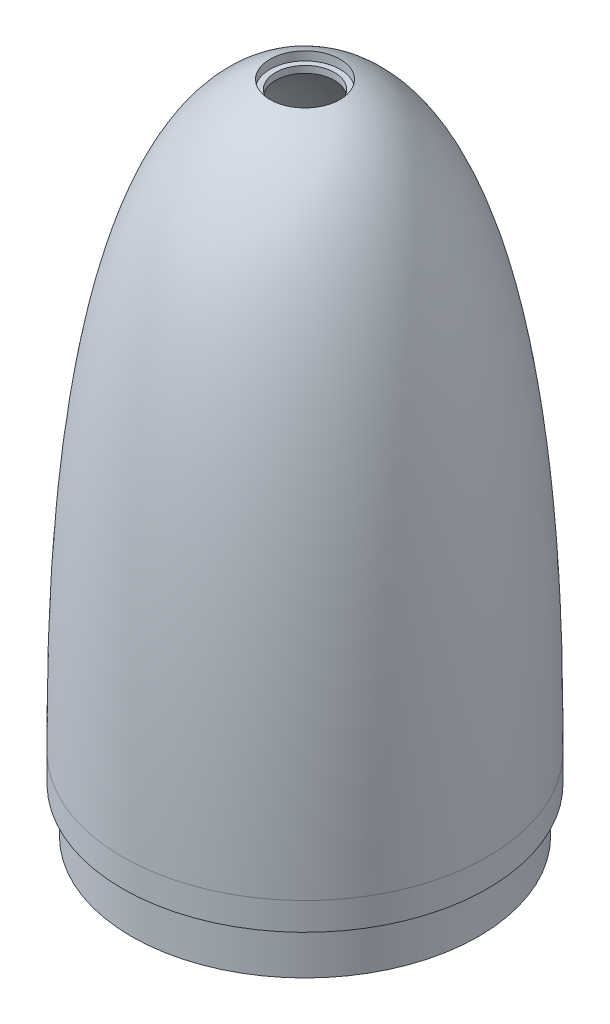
ISO-10303-21;
HEADER;
FILE_DESCRIPTION(('STEP AP214'),'2;1');
FILE_NAME('part.step','',(''),(''),'','','');
FILE_SCHEMA(('AUTOMOTIVE_DESIGN { 1 0 10303 214 1 1 1 1 }'));
ENDSEC;
DATA;
#1=APPLICATION_CONTEXT('core data for automotive mechanical design processes');
#2=APPLICATION_PROTOCOL_DEFINITION('international standard','automotive_design',2000,#1);
#3=PRODUCT_CONTEXT('',#1,'mechanical');
#4=PRODUCT('Part','Part','',(#3));
#5=PRODUCT_RELATED_PRODUCT_CATEGORY('part','',(#4));
#6=PRODUCT_DEFINITION_FORMATION('','',#4);
#7=PRODUCT_DEFINITION_CONTEXT('part definition',#1,'design');
#8=PRODUCT_DEFINITION('design','',#6,#7);
#9=PRODUCT_DEFINITION_SHAPE('','',#8);
#10=(LENGTH_UNIT() NAMED_UNIT(*) SI_UNIT(.MILLI.,.METRE.));
#11=(NAMED_UNIT(*) PLANE_ANGLE_UNIT() SI_UNIT($,.RADIAN.));
#12=(NAMED_UNIT(*) SI_UNIT($,.STERADIAN.) SOLID_ANGLE_UNIT());
#13=UNCERTAINTY_MEASURE_WITH_UNIT(LENGTH_MEASURE(1.E-05),#10,'distance_accuracy_value','');
#14=(GEOMETRIC_REPRESENTATION_CONTEXT(3) GLOBAL_UNCERTAINTY_ASSIGNED_CONTEXT((#13)) GLOBAL_UNIT_ASSIGNED_CONTEXT((#10,
#11,#12)) REPRESENTATION_CONTEXT('',''));
#15=CARTESIAN_POINT('',(0.,0.,0.));
#16=DIRECTION('',(0.,0.,1.));
#17=DIRECTION('',(1.,0.,0.));
#18=AXIS2_PLACEMENT_3D('',#15,#16,#17);
#19=CARTESIAN_POINT('',(33.1,13.2999999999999,0.));
#20=CARTESIAN_POINT('',(33.1,40.9226204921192,0.));
#21=CARTESIAN_POINT('',(32.5499463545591,120.,0.));
#22=CARTESIAN_POINT('',(0.,120.,0.));
#23=B_SPLINE_CURVE_WITH_KNOTS('',3,(#19,#20,#21,#22),.UNSPECIFIED.,.F.,.F.,(4,4),(0.,1.),.UNSPECIFIED.);
#24=CARTESIAN_POINT('',(0.,120.,0.));
#25=DIRECTION('',(0.,1.,0.));
#26=AXIS1_PLACEMENT('',#24,#25);
#27=SURFACE_OF_REVOLUTION('',#23,#26);
#28=CARTESIAN_POINT('',(0.,118.891876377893,0.));
#29=DIRECTION('',(0.,1.,0.));
#30=DIRECTION('',(0.,0.,1.));
#31=AXIS2_PLACEMENT_3D('',#28,#29,#30);
#32=CIRCLE('',#31,6.35000000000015);
#33=CARTESIAN_POINT('',(0.,118.891876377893,6.35000000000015));
#34=VERTEX_POINT('',#33);
#35=EDGE_CURVE('E41',#34,#34,#32,.F.);
#36=ORIENTED_EDGE('',*,*,#35,.T.);
#37=EDGE_LOOP('',(#36));
#38=FACE_BOUND('',#37,.T.);
#39=CARTESIAN_POINT('',(0.,13.3,0.));
#40=DIRECTION('',(0.,1.,0.));
#41=DIRECTION('',(0.,0.,1.));
#42=AXIS2_PLACEMENT_3D('',#39,#40,#41);
#43=CIRCLE('',#42,33.1);
#44=CARTESIAN_POINT('',(0.,13.3,33.1));
#45=VERTEX_POINT('',#44);
#46=EDGE_CURVE('E59',#45,#45,#43,.T.);
#47=ORIENTED_EDGE('',*,*,#46,.T.);
#48=EDGE_LOOP('',(#47));
#49=FACE_BOUND('',#48,.T.);
#50=ADVANCED_FACE('F37',(#38,#49),#27,.T.);
#51=CARTESIAN_POINT('',(0.,117.,0.));
#52=CARTESIAN_POINT('',(0.424061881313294,117.,0.));
#53=CARTESIAN_POINT('',(1.28356271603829,116.967183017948,0.));
#54=CARTESIAN_POINT('',(2.90414984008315,116.776102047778,0.));
#55=CARTESIAN_POINT('',(4.82741332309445,116.311450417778,0.));
#56=CARTESIAN_POINT('',(6.99178935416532,115.407503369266,0.));
#57=CARTESIAN_POINT('',(9.73527188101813,113.74167072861,0.));
#58=CARTESIAN_POINT('',(12.9354102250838,110.783808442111,0.));
#59=CARTESIAN_POINT('',(16.392615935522,105.885181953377,0.));
#60=CARTESIAN_POINT('',(19.4148320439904,99.8036949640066,0.));
#61=CARTESIAN_POINT('',(22.8482524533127,90.3913900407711,0.));
#62=CARTESIAN_POINT('',(26.050874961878,76.7109826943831,0.));
#63=CARTESIAN_POINT('',(28.020441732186,61.8446115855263,0.));
#64=CARTESIAN_POINT('',(29.0269907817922,50.0309970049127,0.));
#65=CARTESIAN_POINT('',(29.5416888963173,41.4052129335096,0.));
#66=CARTESIAN_POINT('',(29.8611044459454,33.2078002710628,0.));
#67=CARTESIAN_POINT('',(30.0023390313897,26.8937011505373,0.));
#68=CARTESIAN_POINT('',(30.0631450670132,22.2490111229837,0.));
#69=CARTESIAN_POINT('',(30.0883692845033,18.9904541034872,0.));
#70=CARTESIAN_POINT('',(30.0971671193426,16.4888333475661,0.));
#71=CARTESIAN_POINT('',(30.0997317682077,14.6120845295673,0.));
#72=CARTESIAN_POINT('',(30.1,13.7431480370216,0.));
#73=CARTESIAN_POINT('',(30.1,13.2999999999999,0.));
#74=B_SPLINE_CURVE_WITH_KNOTS('',3,(#51,#52,#53,#54,#55,#56,#57,#58,#59,#60,#61,#62,#63,#64,#65,
#66,#67,#68,#69,#70,#71,#72,#73),.UNSPECIFIED.,.F.,.F.,(4,1,1,1,1,1,1,1,1,1,1,1,1,1,1,1,1,1,1,1,
4),(0.,0.015625,0.03125,0.0625,0.09375,0.125,0.1875,0.25,0.3125,0.375,0.5,0.625,0.6875,0.75,
0.8125,0.875,0.90625,0.9375,0.96875,0.984375,1.),.UNSPECIFIED.);
#75=CARTESIAN_POINT('',(0.,120.,0.));
#76=DIRECTION('',(0.,1.,0.));
#77=AXIS1_PLACEMENT('',#75,#76);
#78=SURFACE_OF_REVOLUTION('',#74,#77);
#79=CARTESIAN_POINT('',(0.,116.063228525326,0.));
#80=DIRECTION('',(0.,1.,0.));
#81=DIRECTION('',(0.,0.,1.));
#82=AXIS2_PLACEMENT_3D('',#79,#80,#81);
#83=CIRCLE('',#82,5.34999999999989);
#84=CARTESIAN_POINT('',(0.,116.063228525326,5.34999999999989));
#85=VERTEX_POINT('',#84);
#86=EDGE_CURVE('E53',#85,#85,#83,.T.);
#87=ORIENTED_EDGE('',*,*,#86,.T.);
#88=EDGE_LOOP('',(#87));
#89=FACE_BOUND('',#88,.T.);
#90=CARTESIAN_POINT('',(0.,13.2999999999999,0.));
#91=DIRECTION('',(0.,1.,0.));
#92=DIRECTION('',(0.,0.,1.));
#93=AXIS2_PLACEMENT_3D('',#90,#91,#92);
#94=CIRCLE('',#93,30.1);
#95=CARTESIAN_POINT('',(0.,13.2999999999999,30.1));
#96=VERTEX_POINT('',#95);
#97=EDGE_CURVE('E10',#96,#96,#94,.T.);
#98=ORIENTED_EDGE('',*,*,#97,.F.);
#99=EDGE_LOOP('',(#98));
#100=FACE_BOUND('',#99,.T.);
#101=ADVANCED_FACE('F82',(#89,#100),#78,.T.);
#102=CARTESIAN_POINT('',(0.,120.,0.));
#103=DIRECTION('',(0.,1.,0.));
#104=DIRECTION('',(0.,0.,1.));
#105=AXIS2_PLACEMENT_3D('',#102,#103,#104);
#106=CYLINDRICAL_SURFACE('',#105,30.1);
#107=CARTESIAN_POINT('',(0.,0.,0.));
#108=DIRECTION('',(0.,1.,0.));
#109=DIRECTION('',(0.,0.,1.));
#110=AXIS2_PLACEMENT_3D('',#107,#108,#109);
#111=CIRCLE('',#110,30.1);
#112=CARTESIAN_POINT('',(0.,0.,30.1));
#113=VERTEX_POINT('',#112);
#114=EDGE_CURVE('E45',#113,#113,#111,.T.);
#115=ORIENTED_EDGE('',*,*,#114,.F.);
#116=EDGE_LOOP('',(#115));
#117=FACE_BOUND('',#116,.T.);
#118=ORIENTED_EDGE('',*,*,#97,.T.);
#119=EDGE_LOOP('',(#118));
#120=FACE_BOUND('',#119,.T.);
#121=ADVANCED_FACE('F85',(#117,#120),#106,.F.);
#122=CARTESIAN_POINT('',(30.1,0.,0.));
#123=DIRECTION('',(0.,1.,0.));
#124=DIRECTION('',(0.,0.,1.));
#125=AXIS2_PLACEMENT_3D('',#122,#123,#124);
#126=PLANE('',#125);
#127=CARTESIAN_POINT('',(0.,0.,0.));
#128=DIRECTION('',(0.,1.,0.));
#129=DIRECTION('',(0.,0.,1.));
#130=AXIS2_PLACEMENT_3D('',#127,#128,#129);
#131=CIRCLE('',#130,31.5);
#132=CARTESIAN_POINT('',(0.,0.,31.5));
#133=VERTEX_POINT('',#132);
#134=EDGE_CURVE('E50',#133,#133,#131,.T.);
#135=ORIENTED_EDGE('',*,*,#134,.F.);
#136=EDGE_LOOP('',(#135));
#137=FACE_BOUND('',#136,.T.);
#138=ORIENTED_EDGE('',*,*,#114,.T.);
#139=EDGE_LOOP('',(#138));
#140=FACE_BOUND('',#139,.T.);
#141=ADVANCED_FACE('F88',(#137,#140),#126,.F.);
#142=CARTESIAN_POINT('',(0.,120.,0.));
#143=DIRECTION('',(0.,1.,0.));
#144=DIRECTION('',(0.,0.,1.));
#145=AXIS2_PLACEMENT_3D('',#142,#143,#144);
#146=CYLINDRICAL_SURFACE('',#145,31.5);
#147=CARTESIAN_POINT('',(0.,8.3,0.));
#148=DIRECTION('',(0.,1.,0.));
#149=DIRECTION('',(0.,0.,1.));
#150=AXIS2_PLACEMENT_3D('',#147,#148,#149);
#151=CIRCLE('',#150,31.5);
#152=CARTESIAN_POINT('',(0.,8.3,31.5));
#153=VERTEX_POINT('',#152);
#154=EDGE_CURVE('E129',#153,#153,#151,.T.);
#155=ORIENTED_EDGE('',*,*,#154,.F.);
#156=EDGE_LOOP('',(#155));
#157=FACE_BOUND('',#156,.T.);
#158=ORIENTED_EDGE('',*,*,#134,.T.);
#159=EDGE_LOOP('',(#158));
#160=FACE_BOUND('',#159,.T.);
#161=ADVANCED_FACE('F92',(#157,#160),#146,.T.);
#162=CARTESIAN_POINT('',(31.5,8.3,0.));
#163=DIRECTION('',(0.,1.,0.));
#164=DIRECTION('',(0.,0.,1.));
#165=AXIS2_PLACEMENT_3D('',#162,#163,#164);
#166=PLANE('',#165);
#167=CARTESIAN_POINT('',(0.,8.3,0.));
#168=DIRECTION('',(0.,1.,0.));
#169=DIRECTION('',(0.,0.,1.));
#170=AXIS2_PLACEMENT_3D('',#167,#168,#169);
#171=CIRCLE('',#170,33.1);
#172=CARTESIAN_POINT('',(0.,8.3,33.1));
#173=VERTEX_POINT('',#172);
#174=EDGE_CURVE('E127',#173,#173,#171,.T.);
#175=ORIENTED_EDGE('',*,*,#174,.F.);
#176=EDGE_LOOP('',(#175));
#177=FACE_BOUND('',#176,.T.);
#178=ORIENTED_EDGE('',*,*,#154,.T.);
#179=EDGE_LOOP('',(#178));
#180=FACE_BOUND('',#179,.T.);
#181=ADVANCED_FACE('F96',(#177,#180),#166,.F.);
#182=CARTESIAN_POINT('',(0.,120.,0.));
#183=DIRECTION('',(0.,1.,0.));
#184=DIRECTION('',(0.,0.,1.));
#185=AXIS2_PLACEMENT_3D('',#182,#183,#184);
#186=CYLINDRICAL_SURFACE('',#185,33.1);
#187=ORIENTED_EDGE('',*,*,#46,.F.);
#188=EDGE_LOOP('',(#187));
#189=FACE_BOUND('',#188,.T.);
#190=ORIENTED_EDGE('',*,*,#174,.T.);
#191=EDGE_LOOP('',(#190));
#192=FACE_BOUND('',#191,.T.);
#193=ADVANCED_FACE('F100',(#189,#192),#186,.T.);
#194=CARTESIAN_POINT('',(3.43024899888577E-12,-1000.,0.));
#195=DIRECTION('',(0.,-1.,0.));
#196=DIRECTION('',(1.,0.,0.));
#197=AXIS2_PLACEMENT_3D('',#194,#195,#196);
#198=CYLINDRICAL_SURFACE('',#197,6.35000000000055);
#199=CARTESIAN_POINT('',(-4.02383219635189E-13,117.304376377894,0.));
#200=DIRECTION('',(0.,-1.,0.));
#201=DIRECTION('',(1.,0.,0.));
#202=AXIS2_PLACEMENT_3D('',#199,#200,#201);
#203=CIRCLE('',#202,6.35000000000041);
#204=CARTESIAN_POINT('',(6.35000000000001,117.304376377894,0.));
#205=VERTEX_POINT('',#204);
#206=EDGE_CURVE('E55',#205,#205,#203,.T.);
#207=ORIENTED_EDGE('',*,*,#206,.T.);
#208=EDGE_LOOP('',(#207));
#209=FACE_BOUND('',#208,.T.);
#210=ORIENTED_EDGE('',*,*,#35,.F.);
#211=EDGE_LOOP('',(#210));
#212=FACE_BOUND('',#211,.T.);
#213=ADVANCED_FACE('F104',(#209,#212),#198,.F.);
#214=CARTESIAN_POINT('',(3.43024899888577E-12,-1000.,0.));
#215=DIRECTION('',(0.,-1.,0.));
#216=DIRECTION('',(1.,0.,0.));
#217=AXIS2_PLACEMENT_3D('',#214,#215,#216);
#218=CYLINDRICAL_SURFACE('',#217,5.35000000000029);
#219=CARTESIAN_POINT('',(-4.02383219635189E-13,117.304376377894,0.));
#220=DIRECTION('',(0.,-1.,0.));
#221=DIRECTION('',(1.,0.,0.));
#222=AXIS2_PLACEMENT_3D('',#219,#220,#221);
#223=CIRCLE('',#222,5.35000000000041);
#224=CARTESIAN_POINT('',(5.35000000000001,117.304376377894,0.));
#225=VERTEX_POINT('',#224);
#226=EDGE_CURVE('E61',#225,#225,#223,.T.);
#227=ORIENTED_EDGE('',*,*,#226,.F.);
#228=EDGE_LOOP('',(#227));
#229=FACE_BOUND('',#228,.T.);
#230=ORIENTED_EDGE('',*,*,#86,.F.);
#231=EDGE_LOOP('',(#230));
#232=FACE_BOUND('',#231,.T.);
#233=ADVANCED_FACE('F108',(#229,#232),#218,.F.);
#234=CARTESIAN_POINT('',(6.35000000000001,117.304376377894,0.));
#235=DIRECTION('',(0.,-1.,0.));
#236=DIRECTION('',(1.,0.,0.));
#237=AXIS2_PLACEMENT_3D('',#234,#235,#236);
#238=PLANE('',#237);
#239=ORIENTED_EDGE('',*,*,#206,.F.);
#240=EDGE_LOOP('',(#239));
#241=FACE_BOUND('',#240,.T.);
#242=ORIENTED_EDGE('',*,*,#226,.T.);
#243=EDGE_LOOP('',(#242));
#244=FACE_BOUND('',#243,.T.);
#245=ADVANCED_FACE('F109',(#241,#244),#238,.F.);
#246=CLOSED_SHELL('',(#50,#101,#121,#141,#161,#181,#193,#213,#233,#245));
#247=MANIFOLD_SOLID_BREP('B2',#246);
#248=ADVANCED_BREP_SHAPE_REPRESENTATION('',(#18,#247),#14);
#249=SHAPE_DEFINITION_REPRESENTATION(#9,#248);
ENDSEC;
END-ISO-10303-21;
